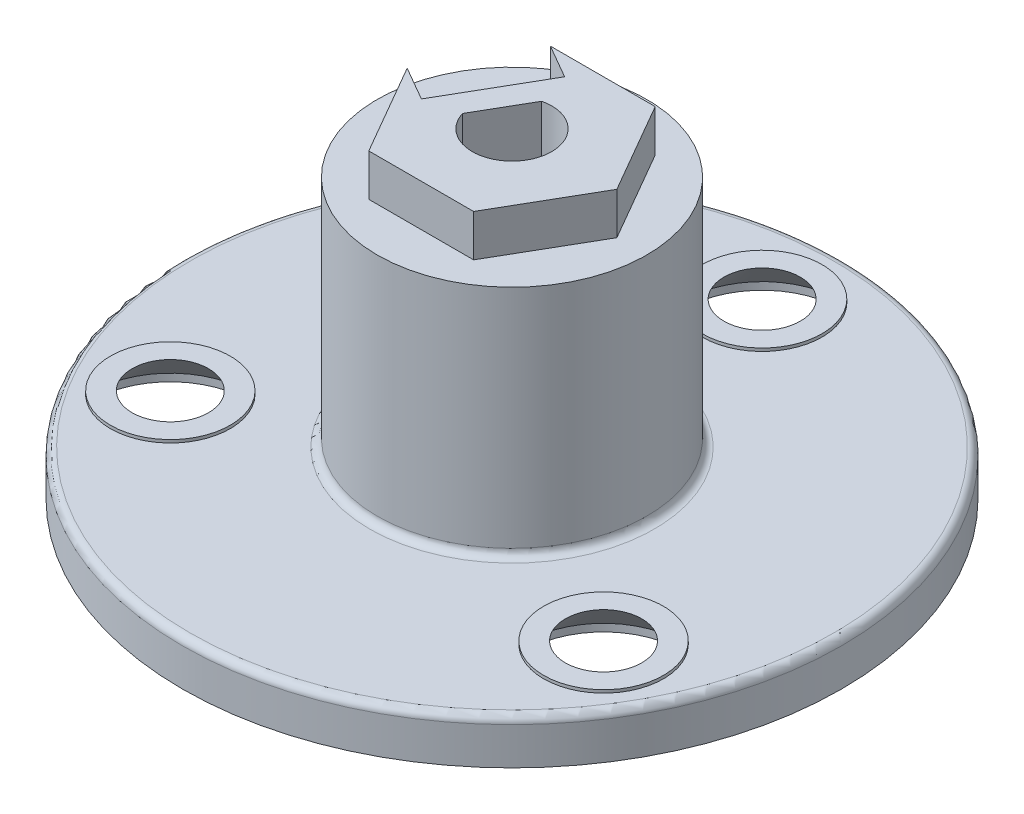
from build123d import *

# Parameters (mm, degrees)
SKETCH_1_R                 = 22
SKETCH_1_R_2               = 2.5
EXTRUDE_1_DEPTH            = 3
SKETCH_2_R                 = 4
SKETCH_2_R_2               = 2.5
EXTRUDE_2_DEPTH            = 0.2
SKETCH_3_R                 = 9
EXTRUDE_3_DEPTH            = 15.4
EXTRUDE_4_DEPTH            = 3
CUT_EXTRUDE_1_DEPTH        = 15
CUT_EXTRUDE_2_DEPTH        = 12
CUT_EXTRUDE_2_DEPTH_BACK   = 4
SKETCH_9_R                 = 9
EXTRUDE_5_DEPTH            = 0.2
HOLE_WIZARD_M51_AT_2_COUNT = 2
HOLE_WIZARD_M51_AT_2_PITCH = 28.925248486
HOLE_WIZARD_M51_AT_3_COUNT = 2
HOLE_WIZARD_M51_AT_3_PITCH = 28.925248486
FILLET_1_R                 = 0.5


with BuildPart() as part:
    # Sketch 1 → Extrude 1 (new body)
    with BuildSketch(Plane(origin=(0, 0, 0), x_dir=(1, 0, 0), z_dir=(0, 1, 0))):
        with Locations(Location((0, 0, 0), (0, 0, 270))):
            Circle(SKETCH_1_R)
        with Locations(Location((0, 16.7, 0), (0, 0, 270))):
            Circle(SKETCH_1_R_2, mode=Mode.SUBTRACT)
        with Locations(Location((14.462624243, -8.35, 0), (0, 0, 270))):
            Circle(SKETCH_1_R_2, mode=Mode.SUBTRACT)
        with Locations(Location((-14.462624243, -8.35, 0), (0, 0, 270))):
            Circle(SKETCH_1_R_2, mode=Mode.SUBTRACT)
        with BuildLine():
            Line((-1.569566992, 0.906189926), (-0.602900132, 2.580506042))
            ThreePointArc((-0.602900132, 2.580506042), (2.29496732, -1.325), (-2.536233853, -0.768126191))
            Line((-2.536233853, -0.768126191), (-1.569566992, 0.906189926))
        make_face(mode=Mode.SUBTRACT)
    extrude(amount=EXTRUDE_1_DEPTH)

    # Sketch 2 → Extrude 2 (add)
    # profile 1 of 3: a face of its own
    with BuildSketch(Plane(origin=(0, 3, 0), x_dir=(1, 0, 0), z_dir=(0, 1, 0))):
        with Locations(Location((0, 16.7, 0), (0, 0, 270))):
            Circle(SKETCH_2_R)
        with Locations(Location((0, 16.7, 0), (0, 0, 270))):
            Circle(SKETCH_2_R_2, mode=Mode.SUBTRACT)
    # profile 2 of 3: a face of its own
    with BuildSketch(Plane(origin=(0, 3, 0), x_dir=(1, 0, 0), z_dir=(0, 1, 0))):
        with Locations(Location((14.462624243, -8.35, 0), (0, 0, 270))):
            Circle(SKETCH_2_R)
        with Locations(Location((14.462624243, -8.35, 0), (0, 0, 270))):
            Circle(SKETCH_2_R_2, mode=Mode.SUBTRACT)
    # profile 3 of 3: a face of its own
    with BuildSketch(Plane(origin=(0, 3, 0), x_dir=(1, 0, 0), z_dir=(0, 1, 0))):
        with Locations(Location((-14.462624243, -8.35, 0), (0, 0, 270))):
            Circle(SKETCH_2_R)
        with Locations(Location((-14.462624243, -8.35, 0), (0, 0, 270))):
            Circle(SKETCH_2_R_2, mode=Mode.SUBTRACT)
    extrude(amount=EXTRUDE_2_DEPTH)

    # Sketch 3 → Extrude 3 (add)
    with BuildSketch(Plane(origin=(0, 3, 0), x_dir=(1, 0, 0), z_dir=(0, 1, 0))):
        with Locations(Location((0, 0, 0), (0, 0, 90))):
            Circle(SKETCH_3_R)
        with BuildLine():
            Line((-2.536233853, -0.768126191), (-0.602900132, 2.580506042))
            ThreePointArc((-0.602900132, 2.580506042), (2.29496732, -1.325), (-2.536233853, -0.768126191))
        make_face(mode=Mode.SUBTRACT)
    extrude(amount=EXTRUDE_3_DEPTH)

    # Sketch 4 → Extrude 4 (add)
    with BuildSketch(Plane(origin=(0, 18.4, 0), x_dir=(1, 0, 0), z_dir=(0, 1, 0))):
        Polygon((7, 0), (3.5, 6.062177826), (-3.5, 6.062177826), (-7, 0), (-3.5, -6.062177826), (3.5, -6.062177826), align=None)
        with BuildLine():
            Line((-2.536233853, -0.768126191), (-0.602900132, 2.580506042))
            ThreePointArc((-0.602900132, 2.580506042), (2.29496732, -1.325), (-2.536233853, -0.768126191))
        make_face(mode=Mode.SUBTRACT)
    extrude(amount=EXTRUDE_4_DEPTH)

    # Sketch 5 → Cut-Extrude 1 (cut)
    with BuildSketch(Plane(origin=(0, 21.4, 0), x_dir=(1, 0, 0), z_dir=(0, 1, 0))):
        Polygon((-7, 0), (-3.5, 6.062177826), (-1.24833395, 4.762177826), (-4.74833395, -1.3), align=None)
    extrude(amount=-CUT_EXTRUDE_1_DEPTH, mode=Mode.SUBTRACT)

    # Sketch 7 → Cut-Extrude 2 (cut, two sides: drawn at the far end of the back side and taken through both)
    with BuildSketch(Plane(origin=(-2.99833395, 0, -1.731088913), x_dir=(-0.4999999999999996, 0, 0.8660254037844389), z_dir=(-0.8660254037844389, 0, -0.4999999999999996)).offset(-CUT_EXTRUDE_2_DEPTH_BACK)):
        Polygon((1.523648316, 10.022822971), (0.761824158, 11.342341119), (-0.761824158, 11.342341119), (-1.523648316, 10.022822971), (-0.761824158, 8.703304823), (0.761824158, 8.703304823), align=None)
    extrude(amount=CUT_EXTRUDE_2_DEPTH + CUT_EXTRUDE_2_DEPTH_BACK, mode=Mode.SUBTRACT)

    # Sketch 9 → Extrude 5 (add)
    with BuildSketch(Plane(origin=(0, 18.4, 0), x_dir=(1, 0, 0), z_dir=(0, 1, 0))):
        with Locations(Location((0, 0, 0), (0, 0, 270))):
            Circle(SKETCH_9_R)
        Polygon((7, 0), (3.5, 6.062177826), (-3.5, 6.062177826), (-7, 0), (-3.5, -6.062177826), (3.5, -6.062177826), align=None, mode=Mode.SUBTRACT)
    extrude(amount=EXTRUDE_5_DEPTH)

    # Sketch 14 → Hole Wizard M51 (revolve, cut)
    with BuildSketch(Plane(origin=(14.462624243, 0, 8.35), x_dir=(0, 0, -1), z_dir=(1, 0, 0))):
        Polygon((0, 0), (0, 21.4), (2.5, 21.4), (2.5, 3.25), (5.25, 0.5), (5.25, 0), align=None)
    hole_wizard_m51 = revolve(axis=Axis((14.462624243, -6.35, 8.35), (0, 1, 0)), mode=Mode.SUBTRACT)

    # Hole Wizard M51 at 2: Hole Wizard M51 ×2
    with Locations(*[(-i * HOLE_WIZARD_M51_AT_2_PITCH, 0, 0) for i in range(1, HOLE_WIZARD_M51_AT_2_COUNT)]):
        add(hole_wizard_m51, mode=Mode.SUBTRACT)

    # Hole Wizard M51 at 3: Hole Wizard M51 ×2
    with Locations(*[Vector(-0.4999999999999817, 0, -0.8660254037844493) * (i * HOLE_WIZARD_M51_AT_3_PITCH) for i in range(1, HOLE_WIZARD_M51_AT_3_COUNT)]):
        add(hole_wizard_m51, mode=Mode.SUBTRACT)

    # Fillet 1
    fillet_1_edges = [part.edges().sort_by_distance(p)[0] for p in [
        (0, 3, 9),
        (0, 3, -22),
    ]]
    fillet(fillet_1_edges, radius=FILLET_1_R)


solid = part.part
